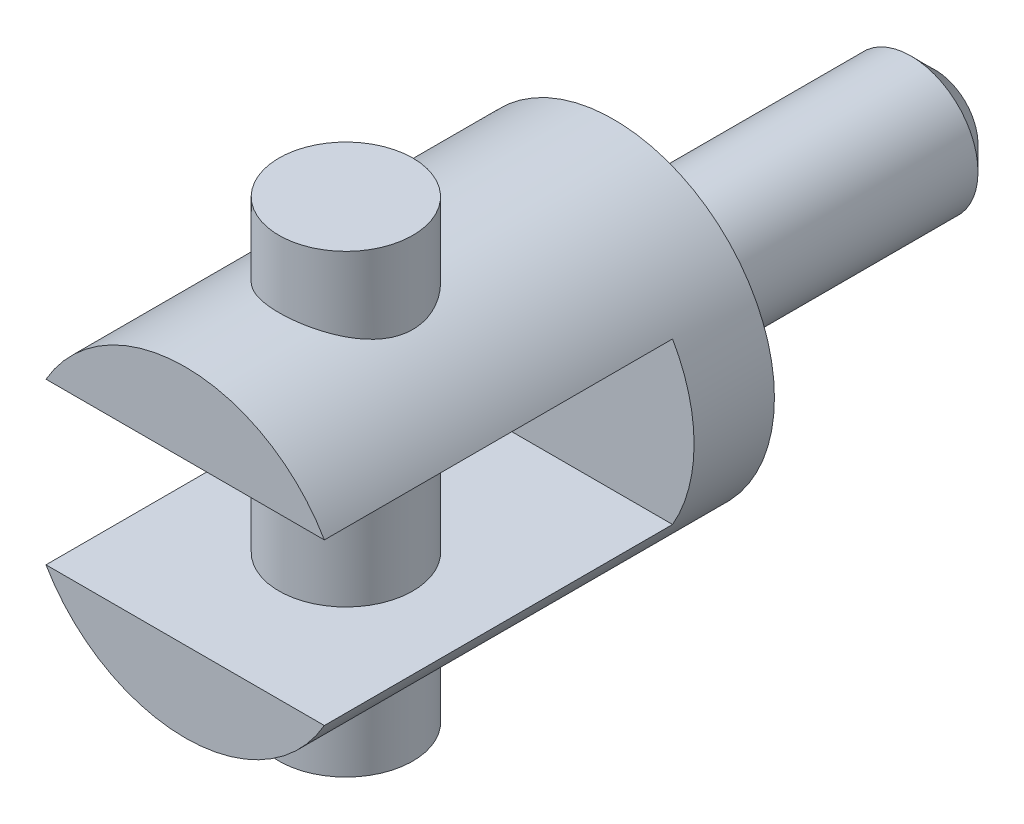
ISO-10303-21;
HEADER;
FILE_DESCRIPTION(('STEP AP214'),'2;1');
FILE_NAME('part.step','',(''),(''),'','','');
FILE_SCHEMA(('AUTOMOTIVE_DESIGN { 1 0 10303 214 1 1 1 1 }'));
ENDSEC;
DATA;
#1=APPLICATION_CONTEXT('core data for automotive mechanical design processes');
#2=APPLICATION_PROTOCOL_DEFINITION('international standard','automotive_design',2000,#1);
#3=PRODUCT_CONTEXT('',#1,'mechanical');
#4=PRODUCT('Part','Part','',(#3));
#5=PRODUCT_RELATED_PRODUCT_CATEGORY('part','',(#4));
#6=PRODUCT_DEFINITION_FORMATION('','',#4);
#7=PRODUCT_DEFINITION_CONTEXT('part definition',#1,'design');
#8=PRODUCT_DEFINITION('design','',#6,#7);
#9=PRODUCT_DEFINITION_SHAPE('','',#8);
#10=(LENGTH_UNIT() NAMED_UNIT(*) SI_UNIT(.MILLI.,.METRE.));
#11=(NAMED_UNIT(*) PLANE_ANGLE_UNIT() SI_UNIT($,.RADIAN.));
#12=(NAMED_UNIT(*) SI_UNIT($,.STERADIAN.) SOLID_ANGLE_UNIT());
#13=UNCERTAINTY_MEASURE_WITH_UNIT(LENGTH_MEASURE(1.E-05),#10,'distance_accuracy_value','');
#14=(GEOMETRIC_REPRESENTATION_CONTEXT(3) GLOBAL_UNCERTAINTY_ASSIGNED_CONTEXT((#13)) GLOBAL_UNIT_ASSIGNED_CONTEXT((#10,
#11,#12)) REPRESENTATION_CONTEXT('',''));
#15=CARTESIAN_POINT('',(0.,0.,0.));
#16=DIRECTION('',(0.,0.,1.));
#17=DIRECTION('',(1.,0.,0.));
#18=AXIS2_PLACEMENT_3D('',#15,#16,#17);
#19=CARTESIAN_POINT('',(0.,0.,16.));
#20=DIRECTION('',(0.,0.,1.));
#21=DIRECTION('',(1.,0.,0.));
#22=AXIS2_PLACEMENT_3D('',#19,#20,#21);
#23=PLANE('',#22);
#24=DIRECTION('',(1.,0.,0.));
#25=VECTOR('',#24,1.);
#26=CARTESIAN_POINT('',(0.,-3.,16.));
#27=LINE('',#26,#25);
#28=CARTESIAN_POINT('',(-5.19615242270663,-3.,16.));
#29=VERTEX_POINT('',#28);
#30=CARTESIAN_POINT('',(5.19615242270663,-3.,16.));
#31=VERTEX_POINT('',#30);
#32=EDGE_CURVE('E37',#29,#31,#27,.T.);
#33=ORIENTED_EDGE('',*,*,#32,.F.);
#34=CARTESIAN_POINT('',(0.,0.,16.));
#35=DIRECTION('',(0.,0.,1.));
#36=DIRECTION('',(1.,0.,0.));
#37=AXIS2_PLACEMENT_3D('',#34,#35,#36);
#38=CIRCLE('',#37,6.);
#39=EDGE_CURVE('E86',#29,#31,#38,.T.);
#40=ORIENTED_EDGE('',*,*,#39,.T.);
#41=EDGE_LOOP('',(#33,#40));
#42=FACE_BOUND('',#41,.T.);
#43=ADVANCED_FACE('F14',(#42),#23,.T.);
#44=DIRECTION('',(-1.,0.,0.));
#45=VECTOR('',#44,1.);
#46=CARTESIAN_POINT('',(0.,3.,16.));
#47=LINE('',#46,#45);
#48=CARTESIAN_POINT('',(5.19615242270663,3.,16.));
#49=VERTEX_POINT('',#48);
#50=CARTESIAN_POINT('',(-5.19615242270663,3.,16.));
#51=VERTEX_POINT('',#50);
#52=EDGE_CURVE('E56',#49,#51,#47,.T.);
#53=ORIENTED_EDGE('',*,*,#52,.F.);
#54=EDGE_CURVE('E85',#49,#51,#38,.T.);
#55=ORIENTED_EDGE('',*,*,#54,.T.);
#56=EDGE_LOOP('',(#53,#55));
#57=FACE_BOUND('',#56,.T.);
#58=ADVANCED_FACE('F150',(#57),#23,.T.);
#59=CARTESIAN_POINT('',(0.,0.,30.));
#60=DIRECTION('',(0.,0.,1.));
#61=DIRECTION('',(1.,0.,0.));
#62=AXIS2_PLACEMENT_3D('',#59,#60,#61);
#63=CYLINDRICAL_SURFACE('',#62,6.);
#64=CARTESIAN_POINT('',(0.,6.,7.5));
#65=CARTESIAN_POINT('',(-0.13390391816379,5.99999628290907,7.5000047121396));
#66=CARTESIAN_POINT('',(-0.268039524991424,5.99546656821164,7.51082131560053));
#67=CARTESIAN_POINT('',(-0.532498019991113,5.97780115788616,7.55368073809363));
#68=CARTESIAN_POINT('',(-0.66281002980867,5.96464300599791,7.58577894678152));
#69=CARTESIAN_POINT('',(-0.915376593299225,5.93112629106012,7.6698214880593));
#70=CARTESIAN_POINT('',(-1.03765681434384,5.91079213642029,7.72169859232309));
#71=CARTESIAN_POINT('',(-1.27165974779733,5.8649055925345,7.84354583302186));
#72=CARTESIAN_POINT('',(-1.38338564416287,5.83935478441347,7.91351048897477));
#73=CARTESIAN_POINT('',(-1.59889674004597,5.78415660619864,8.07325791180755));
#74=CARTESIAN_POINT('',(-1.70208251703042,5.75437507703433,8.1638026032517));
#75=CARTESIAN_POINT('',(-1.8923196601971,5.69465427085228,8.36052868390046));
#76=CARTESIAN_POINT('',(-1.9793625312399,5.66471491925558,8.46671825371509));
#77=CARTESIAN_POINT('',(-2.13907474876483,5.60642043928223,8.69805355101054));
#78=CARTESIAN_POINT('',(-2.2108261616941,5.57821573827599,8.82387489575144));
#79=CARTESIAN_POINT('',(-2.331878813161,5.52871144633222,9.08714651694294));
#80=CARTESIAN_POINT('',(-2.38119161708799,5.50740829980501,9.2245907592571));
#81=CARTESIAN_POINT('',(-2.45349196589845,5.47557110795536,9.50030738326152));
#82=CARTESIAN_POINT('',(-2.47763315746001,5.46456775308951,9.63822096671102));
#83=CARTESIAN_POINT('',(-2.50250419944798,5.45322652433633,9.91654658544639));
#84=CARTESIAN_POINT('',(-2.5032469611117,5.45288276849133,10.0569572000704));
#85=CARTESIAN_POINT('',(-2.48216900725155,5.46250239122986,10.3248001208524));
#86=CARTESIAN_POINT('',(-2.46207362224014,5.47167765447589,10.4524021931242));
#87=CARTESIAN_POINT('',(-2.40278382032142,5.49796965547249,10.7022241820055));
#88=CARTESIAN_POINT('',(-2.36358574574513,5.51508791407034,10.8244430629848));
#89=CARTESIAN_POINT('',(-2.2664391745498,5.55572369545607,11.0631154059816));
#90=CARTESIAN_POINT('',(-2.20810943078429,5.57936963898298,11.1793908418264));
#91=CARTESIAN_POINT('',(-2.07462485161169,5.63036662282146,11.4009554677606));
#92=CARTESIAN_POINT('',(-1.99946338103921,5.65771912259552,11.5062403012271));
#93=CARTESIAN_POINT('',(-1.82699193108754,5.71585953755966,11.7121999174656));
#94=CARTESIAN_POINT('',(-1.72834696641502,5.74674242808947,11.8117331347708));
#95=CARTESIAN_POINT('',(-1.51545918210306,5.80651346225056,11.9932270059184));
#96=CARTESIAN_POINT('',(-1.40121271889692,5.83540113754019,12.0751835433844));
#97=CARTESIAN_POINT('',(-1.15689589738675,5.88876567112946,12.2208716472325));
#98=CARTESIAN_POINT('',(-1.02652116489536,5.91312533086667,12.2841388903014));
#99=CARTESIAN_POINT('',(-0.755704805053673,5.95378962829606,12.3874422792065));
#100=CARTESIAN_POINT('',(-0.615268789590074,5.970098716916,12.4274912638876));
#101=CARTESIAN_POINT('',(-0.337856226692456,5.9919928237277,12.4808319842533));
#102=CARTESIAN_POINT('',(-0.201222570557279,5.9981908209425,12.4956557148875));
#103=CARTESIAN_POINT('',(0.0727093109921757,6.00112100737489,12.5026924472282));
#104=CARTESIAN_POINT('',(0.210007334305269,5.99785591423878,12.494911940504));
#105=CARTESIAN_POINT('',(0.474196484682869,5.9826243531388,12.4580578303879));
#106=CARTESIAN_POINT('',(0.601265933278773,5.97109774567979,12.4300600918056));
#107=CARTESIAN_POINT('',(0.848765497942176,5.94097213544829,12.3550636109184));
#108=CARTESIAN_POINT('',(0.969194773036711,5.92237223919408,12.3080624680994));
#109=CARTESIAN_POINT('',(1.20421799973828,5.87916541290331,12.1948580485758));
#110=CARTESIAN_POINT('',(1.31851447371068,5.85438982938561,12.128103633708));
#111=CARTESIAN_POINT('',(1.53469243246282,5.80147609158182,11.9778932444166));
#112=CARTESIAN_POINT('',(1.63656870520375,5.77333653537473,11.8944302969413));
#113=CARTESIAN_POINT('',(1.83266686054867,5.71424175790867,11.7061935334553));
#114=CARTESIAN_POINT('',(1.92582139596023,5.68322903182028,11.6003229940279));
#115=CARTESIAN_POINT('',(2.09333969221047,5.6236867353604,11.3739574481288));
#116=CARTESIAN_POINT('',(2.16769918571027,5.59515772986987,11.253459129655));
#117=CARTESIAN_POINT('',(2.29631920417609,5.54362772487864,10.9987716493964));
#118=CARTESIAN_POINT('',(2.35027836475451,5.52071125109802,10.8644119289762));
#119=CARTESIAN_POINT('',(2.43434827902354,5.48416711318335,10.5872588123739));
#120=CARTESIAN_POINT('',(2.46447869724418,5.47053179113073,10.4444724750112));
#121=CARTESIAN_POINT('',(2.49808160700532,5.4552632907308,10.1663626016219));
#122=CARTESIAN_POINT('',(2.50342760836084,5.45278701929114,10.0313106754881));
#123=CARTESIAN_POINT('',(2.49231151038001,5.45787706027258,9.76231427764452));
#124=CARTESIAN_POINT('',(2.47585275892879,5.46544183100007,9.6283696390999));
#125=CARTESIAN_POINT('',(2.42316809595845,5.48899102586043,9.37181450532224));
#126=CARTESIAN_POINT('',(2.38789807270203,5.50456709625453,9.24896665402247));
#127=CARTESIAN_POINT('',(2.29952656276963,5.54206362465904,9.01090395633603));
#128=CARTESIAN_POINT('',(2.24642006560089,5.56398586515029,8.89569126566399));
#129=CARTESIAN_POINT('',(2.1202057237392,5.61333908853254,8.66860821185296));
#130=CARTESIAN_POINT('',(2.04608723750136,5.64102204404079,8.55735535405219));
#131=CARTESIAN_POINT('',(1.88136812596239,5.69807379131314,8.34827970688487));
#132=CARTESIAN_POINT('',(1.79076178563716,5.72744316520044,8.25046159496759));
#133=CARTESIAN_POINT('',(1.58780416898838,5.78712781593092,8.06370269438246));
#134=CARTESIAN_POINT('',(1.47434977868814,5.81735619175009,7.9759273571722));
#135=CARTESIAN_POINT('',(1.23319985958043,5.87320303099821,7.82060086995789));
#136=CARTESIAN_POINT('',(1.1054978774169,5.89881939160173,7.75305893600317));
#137=CARTESIAN_POINT('',(0.841465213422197,5.94218308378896,7.6415811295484));
#138=CARTESIAN_POINT('',(0.70531205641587,5.96005349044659,7.59727350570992));
#139=CARTESIAN_POINT('',(0.42681678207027,5.9864223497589,7.53258431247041));
#140=CARTESIAN_POINT('',(0.284495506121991,5.99495014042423,7.5121278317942));
#141=CARTESIAN_POINT('',(0.118052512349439,5.99888566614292,7.50267615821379));
#142=CARTESIAN_POINT('',(0.0944569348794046,5.99930292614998,7.50167339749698));
#143=CARTESIAN_POINT('',(0.0472433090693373,5.99986042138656,7.50033490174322));
#144=CARTESIAN_POINT('',(0.023625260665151,6.0000006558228,7.49999916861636));
#145=CARTESIAN_POINT('',(0.,6.,7.5));
#146=B_SPLINE_CURVE_WITH_KNOTS('',3,(#64,#65,#66,#67,#68,#69,#70,#71,#72,#73,#74,#75,#76,#77,
#78,#79,#80,#81,#82,#83,#84,#85,#86,#87,#88,#89,#90,#91,#92,#93,#94,#95,#96,#97,#98,#99,#100,
#101,#102,#103,#104,#105,#106,#107,#108,#109,#110,#111,#112,#113,#114,#115,#116,#117,#118,#119,
#120,#121,#122,#123,#124,#125,#126,#127,#128,#129,#130,#131,#132,#133,#134,#135,#136,#137,#138,
#139,#140,#141,#142,#143,#144,#145),.UNSPECIFIED.,.T.,.F.,(4,2,2,2,2,2,2,2,2,2,2,2,2,2,2,2,2,2,
2,2,2,2,2,2,2,2,2,2,2,2,2,2,2,2,2,2,2,2,2,2,4),(0.,0.401613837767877,0.804277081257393,
1.2055837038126,1.60676887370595,2.02635872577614,2.44616876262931,2.88663449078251,
3.32687293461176,3.74590546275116,4.16470676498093,4.55140314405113,4.93817359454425,
5.33317426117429,5.72833091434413,6.15688282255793,6.58553498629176,7.02408110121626,
7.46238448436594,7.87296886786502,8.28343534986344,8.67353179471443,9.0636775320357,
9.46594270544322,9.86837610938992,10.2995697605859,10.7308612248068,11.1682957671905,
11.6053689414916,12.0087975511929,12.4121642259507,12.7967529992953,13.1814498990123,
13.5892778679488,13.9972474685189,14.4349307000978,14.8728129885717,15.3034571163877,
15.7327450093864,15.8036033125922,15.8744618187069),.UNSPECIFIED.);
#147=CARTESIAN_POINT('',(0.,6.,7.5));
#148=VERTEX_POINT('',#147);
#149=EDGE_CURVE('E98',#148,#148,#146,.T.);
#150=ORIENTED_EDGE('',*,*,#149,.F.);
#151=EDGE_LOOP('',(#150));
#152=FACE_BOUND('',#151,.T.);
#153=CARTESIAN_POINT('',(0.,-6.,7.5));
#154=CARTESIAN_POINT('',(0.13390391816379,-5.99999628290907,7.5000047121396));
#155=CARTESIAN_POINT('',(0.268039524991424,-5.99546656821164,7.51082131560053));
#156=CARTESIAN_POINT('',(0.532498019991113,-5.97780115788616,7.55368073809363));
#157=CARTESIAN_POINT('',(0.66281002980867,-5.96464300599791,7.58577894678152));
#158=CARTESIAN_POINT('',(0.915376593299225,-5.93112629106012,7.6698214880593));
#159=CARTESIAN_POINT('',(1.03765681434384,-5.91079213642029,7.72169859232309));
#160=CARTESIAN_POINT('',(1.27165974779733,-5.8649055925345,7.84354583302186));
#161=CARTESIAN_POINT('',(1.38338564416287,-5.83935478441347,7.91351048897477));
#162=CARTESIAN_POINT('',(1.59889674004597,-5.78415660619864,8.07325791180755));
#163=CARTESIAN_POINT('',(1.70208251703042,-5.75437507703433,8.1638026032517));
#164=CARTESIAN_POINT('',(1.8923196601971,-5.69465427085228,8.36052868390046));
#165=CARTESIAN_POINT('',(1.9793625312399,-5.66471491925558,8.46671825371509));
#166=CARTESIAN_POINT('',(2.13907474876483,-5.60642043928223,8.69805355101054));
#167=CARTESIAN_POINT('',(2.2108261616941,-5.57821573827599,8.82387489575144));
#168=CARTESIAN_POINT('',(2.331878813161,-5.52871144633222,9.08714651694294));
#169=CARTESIAN_POINT('',(2.38119161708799,-5.50740829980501,9.2245907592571));
#170=CARTESIAN_POINT('',(2.45349196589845,-5.47557110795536,9.50030738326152));
#171=CARTESIAN_POINT('',(2.47763315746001,-5.46456775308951,9.63822096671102));
#172=CARTESIAN_POINT('',(2.50250419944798,-5.45322652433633,9.91654658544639));
#173=CARTESIAN_POINT('',(2.5032469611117,-5.45288276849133,10.0569572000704));
#174=CARTESIAN_POINT('',(2.48216900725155,-5.46250239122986,10.3248001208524));
#175=CARTESIAN_POINT('',(2.46207362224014,-5.47167765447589,10.4524021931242));
#176=CARTESIAN_POINT('',(2.40278382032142,-5.49796965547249,10.7022241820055));
#177=CARTESIAN_POINT('',(2.36358574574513,-5.51508791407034,10.8244430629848));
#178=CARTESIAN_POINT('',(2.2664391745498,-5.55572369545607,11.0631154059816));
#179=CARTESIAN_POINT('',(2.20810943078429,-5.57936963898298,11.1793908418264));
#180=CARTESIAN_POINT('',(2.07462485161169,-5.63036662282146,11.4009554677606));
#181=CARTESIAN_POINT('',(1.99946338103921,-5.65771912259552,11.5062403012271));
#182=CARTESIAN_POINT('',(1.82699193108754,-5.71585953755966,11.7121999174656));
#183=CARTESIAN_POINT('',(1.72834696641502,-5.74674242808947,11.8117331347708));
#184=CARTESIAN_POINT('',(1.51545918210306,-5.80651346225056,11.9932270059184));
#185=CARTESIAN_POINT('',(1.40121271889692,-5.83540113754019,12.0751835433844));
#186=CARTESIAN_POINT('',(1.15689589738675,-5.88876567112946,12.2208716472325));
#187=CARTESIAN_POINT('',(1.02652116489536,-5.91312533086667,12.2841388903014));
#188=CARTESIAN_POINT('',(0.755704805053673,-5.95378962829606,12.3874422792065));
#189=CARTESIAN_POINT('',(0.615268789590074,-5.970098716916,12.4274912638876));
#190=CARTESIAN_POINT('',(0.337856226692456,-5.9919928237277,12.4808319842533));
#191=CARTESIAN_POINT('',(0.201222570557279,-5.9981908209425,12.4956557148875));
#192=CARTESIAN_POINT('',(-0.0727093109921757,-6.00112100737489,12.5026924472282));
#193=CARTESIAN_POINT('',(-0.210007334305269,-5.99785591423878,12.494911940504));
#194=CARTESIAN_POINT('',(-0.474196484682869,-5.9826243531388,12.4580578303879));
#195=CARTESIAN_POINT('',(-0.601265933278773,-5.97109774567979,12.4300600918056));
#196=CARTESIAN_POINT('',(-0.848765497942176,-5.94097213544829,12.3550636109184));
#197=CARTESIAN_POINT('',(-0.969194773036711,-5.92237223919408,12.3080624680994));
#198=CARTESIAN_POINT('',(-1.20421799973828,-5.87916541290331,12.1948580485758));
#199=CARTESIAN_POINT('',(-1.31851447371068,-5.85438982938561,12.128103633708));
#200=CARTESIAN_POINT('',(-1.53469243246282,-5.80147609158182,11.9778932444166));
#201=CARTESIAN_POINT('',(-1.63656870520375,-5.77333653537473,11.8944302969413));
#202=CARTESIAN_POINT('',(-1.83266686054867,-5.71424175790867,11.7061935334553));
#203=CARTESIAN_POINT('',(-1.92582139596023,-5.68322903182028,11.6003229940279));
#204=CARTESIAN_POINT('',(-2.09333969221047,-5.6236867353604,11.3739574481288));
#205=CARTESIAN_POINT('',(-2.16769918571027,-5.59515772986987,11.253459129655));
#206=CARTESIAN_POINT('',(-2.29631920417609,-5.54362772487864,10.9987716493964));
#207=CARTESIAN_POINT('',(-2.35027836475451,-5.52071125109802,10.8644119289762));
#208=CARTESIAN_POINT('',(-2.43434827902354,-5.48416711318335,10.5872588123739));
#209=CARTESIAN_POINT('',(-2.46447869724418,-5.47053179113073,10.4444724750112));
#210=CARTESIAN_POINT('',(-2.49808160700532,-5.4552632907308,10.1663626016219));
#211=CARTESIAN_POINT('',(-2.50342760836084,-5.45278701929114,10.0313106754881));
#212=CARTESIAN_POINT('',(-2.49231151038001,-5.45787706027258,9.76231427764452));
#213=CARTESIAN_POINT('',(-2.47585275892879,-5.46544183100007,9.6283696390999));
#214=CARTESIAN_POINT('',(-2.42316809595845,-5.48899102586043,9.37181450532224));
#215=CARTESIAN_POINT('',(-2.38789807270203,-5.50456709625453,9.24896665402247));
#216=CARTESIAN_POINT('',(-2.29952656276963,-5.54206362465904,9.01090395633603));
#217=CARTESIAN_POINT('',(-2.24642006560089,-5.56398586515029,8.89569126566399));
#218=CARTESIAN_POINT('',(-2.1202057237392,-5.61333908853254,8.66860821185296));
#219=CARTESIAN_POINT('',(-2.04608723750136,-5.64102204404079,8.55735535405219));
#220=CARTESIAN_POINT('',(-1.88136812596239,-5.69807379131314,8.34827970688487));
#221=CARTESIAN_POINT('',(-1.79076178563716,-5.72744316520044,8.25046159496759));
#222=CARTESIAN_POINT('',(-1.58780416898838,-5.78712781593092,8.06370269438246));
#223=CARTESIAN_POINT('',(-1.47434977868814,-5.81735619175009,7.9759273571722));
#224=CARTESIAN_POINT('',(-1.23319985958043,-5.87320303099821,7.82060086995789));
#225=CARTESIAN_POINT('',(-1.1054978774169,-5.89881939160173,7.75305893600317));
#226=CARTESIAN_POINT('',(-0.841465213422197,-5.94218308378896,7.6415811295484));
#227=CARTESIAN_POINT('',(-0.70531205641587,-5.96005349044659,7.59727350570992));
#228=CARTESIAN_POINT('',(-0.42681678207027,-5.9864223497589,7.53258431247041));
#229=CARTESIAN_POINT('',(-0.284495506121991,-5.99495014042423,7.5121278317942));
#230=CARTESIAN_POINT('',(-0.118052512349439,-5.99888566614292,7.50267615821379));
#231=CARTESIAN_POINT('',(-0.0944569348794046,-5.99930292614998,7.50167339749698));
#232=CARTESIAN_POINT('',(-0.0472433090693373,-5.99986042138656,7.50033490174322));
#233=CARTESIAN_POINT('',(-0.023625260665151,-6.0000006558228,7.49999916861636));
#234=CARTESIAN_POINT('',(0.,-6.,7.5));
#235=B_SPLINE_CURVE_WITH_KNOTS('',3,(#153,#154,#155,#156,#157,#158,#159,#160,#161,#162,#163,
#164,#165,#166,#167,#168,#169,#170,#171,#172,#173,#174,#175,#176,#177,#178,#179,#180,#181,#182,
#183,#184,#185,#186,#187,#188,#189,#190,#191,#192,#193,#194,#195,#196,#197,#198,#199,#200,#201,
#202,#203,#204,#205,#206,#207,#208,#209,#210,#211,#212,#213,#214,#215,#216,#217,#218,#219,#220,
#221,#222,#223,#224,#225,#226,#227,#228,#229,#230,#231,#232,#233,#234),.UNSPECIFIED.,.T.,.F.,(4,
2,2,2,2,2,2,2,2,2,2,2,2,2,2,2,2,2,2,2,2,2,2,2,2,2,2,2,2,2,2,2,2,2,2,2,2,2,2,2,4),(0.,
0.401613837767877,0.804277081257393,1.2055837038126,1.60676887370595,2.02635872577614,
2.44616876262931,2.88663449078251,3.32687293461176,3.74590546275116,4.16470676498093,
4.55140314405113,4.93817359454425,5.33317426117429,5.72833091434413,6.15688282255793,
6.58553498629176,7.02408110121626,7.46238448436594,7.87296886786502,8.28343534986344,
8.67353179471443,9.0636775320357,9.46594270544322,9.86837610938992,10.2995697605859,
10.7308612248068,11.1682957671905,11.6053689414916,12.0087975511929,12.4121642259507,
12.7967529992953,13.1814498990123,13.5892778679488,13.9972474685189,14.4349307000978,
14.8728129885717,15.3034571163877,15.7327450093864,15.8036033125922,15.8744618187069),.UNSPECIFIED.);
#236=CARTESIAN_POINT('',(0.,-6.,7.5));
#237=VERTEX_POINT('',#236);
#238=EDGE_CURVE('E80',#237,#237,#235,.T.);
#239=ORIENTED_EDGE('',*,*,#238,.F.);
#240=EDGE_LOOP('',(#239));
#241=FACE_BOUND('',#240,.T.);
#242=DIRECTION('',(0.,0.,1.));
#243=VECTOR('',#242,1.);
#244=CARTESIAN_POINT('',(-5.19615242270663,-3.,30.));
#245=LINE('',#244,#243);
#246=CARTESIAN_POINT('',(-5.19615242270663,-3.,3.));
#247=VERTEX_POINT('',#246);
#248=EDGE_CURVE('E78',#247,#29,#245,.T.);
#249=ORIENTED_EDGE('',*,*,#248,.F.);
#250=CARTESIAN_POINT('',(0.,0.,3.));
#251=DIRECTION('',(0.,0.,-1.));
#252=DIRECTION('',(-1.,0.,0.));
#253=AXIS2_PLACEMENT_3D('',#250,#251,#252);
#254=CIRCLE('',#253,6.);
#255=CARTESIAN_POINT('',(-5.19615242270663,3.,3.));
#256=VERTEX_POINT('',#255);
#257=EDGE_CURVE('E61',#256,#247,#254,.F.);
#258=ORIENTED_EDGE('',*,*,#257,.F.);
#259=DIRECTION('',(0.,0.,1.));
#260=VECTOR('',#259,1.);
#261=CARTESIAN_POINT('',(-5.19615242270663,3.,30.));
#262=LINE('',#261,#260);
#263=EDGE_CURVE('E53',#51,#256,#262,.F.);
#264=ORIENTED_EDGE('',*,*,#263,.F.);
#265=ORIENTED_EDGE('',*,*,#54,.F.);
#266=DIRECTION('',(0.,0.,1.));
#267=VECTOR('',#266,1.);
#268=CARTESIAN_POINT('',(5.19615242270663,3.,30.));
#269=LINE('',#268,#267);
#270=CARTESIAN_POINT('',(5.19615242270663,3.,3.));
#271=VERTEX_POINT('',#270);
#272=EDGE_CURVE('E84',#271,#49,#269,.T.);
#273=ORIENTED_EDGE('',*,*,#272,.F.);
#274=CARTESIAN_POINT('',(5.19615242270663,-3.,3.));
#275=VERTEX_POINT('',#274);
#276=EDGE_CURVE('E69',#275,#271,#254,.F.);
#277=ORIENTED_EDGE('',*,*,#276,.F.);
#278=DIRECTION('',(0.,0.,1.));
#279=VECTOR('',#278,1.);
#280=CARTESIAN_POINT('',(5.19615242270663,-3.,30.));
#281=LINE('',#280,#279);
#282=EDGE_CURVE('E62',#31,#275,#281,.F.);
#283=ORIENTED_EDGE('',*,*,#282,.F.);
#284=ORIENTED_EDGE('',*,*,#39,.F.);
#285=EDGE_LOOP('',(#249,#258,#264,#265,#273,#277,#283,#284));
#286=FACE_BOUND('',#285,.T.);
#287=CARTESIAN_POINT('',(0.,0.,0.));
#288=DIRECTION('',(0.,0.,1.));
#289=DIRECTION('',(1.,0.,0.));
#290=AXIS2_PLACEMENT_3D('',#287,#288,#289);
#291=CIRCLE('',#290,6.);
#292=CARTESIAN_POINT('',(6.,0.,0.));
#293=VERTEX_POINT('',#292);
#294=EDGE_CURVE('E89',#293,#293,#291,.T.);
#295=ORIENTED_EDGE('',*,*,#294,.T.);
#296=EDGE_LOOP('',(#295));
#297=FACE_BOUND('',#296,.T.);
#298=ADVANCED_FACE('F75',(#152,#241,#286,#297),#63,.T.);
#299=CARTESIAN_POINT('',(6.,0.,0.));
#300=DIRECTION('',(0.,0.,-1.));
#301=DIRECTION('',(-1.,0.,0.));
#302=AXIS2_PLACEMENT_3D('',#299,#300,#301);
#303=PLANE('',#302);
#304=CARTESIAN_POINT('',(0.,0.,0.));
#305=DIRECTION('',(0.,0.,1.));
#306=DIRECTION('',(1.,0.,0.));
#307=AXIS2_PLACEMENT_3D('',#304,#305,#306);
#308=CIRCLE('',#307,2.5);
#309=CARTESIAN_POINT('',(2.5,0.,0.));
#310=VERTEX_POINT('',#309);
#311=EDGE_CURVE('E92',#310,#310,#308,.T.);
#312=ORIENTED_EDGE('',*,*,#311,.T.);
#313=EDGE_LOOP('',(#312));
#314=FACE_BOUND('',#313,.T.);
#315=ORIENTED_EDGE('',*,*,#294,.F.);
#316=EDGE_LOOP('',(#315));
#317=FACE_BOUND('',#316,.T.);
#318=ADVANCED_FACE('F141',(#314,#317),#303,.T.);
#319=CARTESIAN_POINT('',(0.,0.,30.));
#320=DIRECTION('',(0.,0.,1.));
#321=DIRECTION('',(1.,0.,0.));
#322=AXIS2_PLACEMENT_3D('',#319,#320,#321);
#323=CYLINDRICAL_SURFACE('',#322,2.5);
#324=CARTESIAN_POINT('',(0.,0.,-11.1));
#325=DIRECTION('',(0.,0.,-1.));
#326=DIRECTION('',(-1.,0.,0.));
#327=AXIS2_PLACEMENT_3D('',#324,#325,#326);
#328=CIRCLE('',#327,2.5);
#329=CARTESIAN_POINT('',(-2.5,0.,-11.1));
#330=VERTEX_POINT('',#329);
#331=EDGE_CURVE('E22',#330,#330,#328,.F.);
#332=ORIENTED_EDGE('',*,*,#331,.T.);
#333=EDGE_LOOP('',(#332));
#334=FACE_BOUND('',#333,.T.);
#335=ORIENTED_EDGE('',*,*,#311,.F.);
#336=EDGE_LOOP('',(#335));
#337=FACE_BOUND('',#336,.T.);
#338=ADVANCED_FACE('F138',(#334,#337),#323,.T.);
#339=CARTESIAN_POINT('',(2.5,0.,-12.));
#340=DIRECTION('',(0.,0.,-1.));
#341=DIRECTION('',(-1.,0.,0.));
#342=AXIS2_PLACEMENT_3D('',#339,#340,#341);
#343=PLANE('',#342);
#344=CARTESIAN_POINT('',(0.,0.,-12.));
#345=DIRECTION('',(0.,0.,-1.));
#346=DIRECTION('',(-1.,0.,0.));
#347=AXIS2_PLACEMENT_3D('',#344,#345,#346);
#348=CIRCLE('',#347,1.6);
#349=CARTESIAN_POINT('',(-1.6,0.,-12.));
#350=VERTEX_POINT('',#349);
#351=EDGE_CURVE('E9',#350,#350,#348,.T.);
#352=ORIENTED_EDGE('',*,*,#351,.T.);
#353=EDGE_LOOP('',(#352));
#354=FACE_BOUND('',#353,.T.);
#355=ADVANCED_FACE('F129',(#354),#343,.T.);
#356=CARTESIAN_POINT('',(-10.,-3.,3.));
#357=DIRECTION('',(0.,0.,-1.));
#358=DIRECTION('',(-1.,0.,0.));
#359=AXIS2_PLACEMENT_3D('',#356,#357,#358);
#360=PLANE('',#359);
#361=ORIENTED_EDGE('',*,*,#276,.T.);
#362=DIRECTION('',(1.,0.,0.));
#363=VECTOR('',#362,1.);
#364=CARTESIAN_POINT('',(-10.,3.,3.));
#365=LINE('',#364,#363);
#366=EDGE_CURVE('E29',#256,#271,#365,.T.);
#367=ORIENTED_EDGE('',*,*,#366,.F.);
#368=ORIENTED_EDGE('',*,*,#257,.T.);
#369=DIRECTION('',(1.,0.,0.));
#370=VECTOR('',#369,1.);
#371=CARTESIAN_POINT('',(-10.,-3.,3.));
#372=LINE('',#371,#370);
#373=EDGE_CURVE('E71',#247,#275,#372,.T.);
#374=ORIENTED_EDGE('',*,*,#373,.T.);
#375=EDGE_LOOP('',(#361,#367,#368,#374));
#376=FACE_BOUND('',#375,.T.);
#377=ADVANCED_FACE('F65',(#376),#360,.F.);
#378=CARTESIAN_POINT('',(-10.,-3.,20.));
#379=DIRECTION('',(0.,-1.,0.));
#380=DIRECTION('',(0.,0.,-1.));
#381=AXIS2_PLACEMENT_3D('',#378,#379,#380);
#382=PLANE('',#381);
#383=CARTESIAN_POINT('',(0.,-3.,10.));
#384=DIRECTION('',(0.,-1.,0.));
#385=DIRECTION('',(0.,0.,-1.));
#386=AXIS2_PLACEMENT_3D('',#383,#384,#385);
#387=CIRCLE('',#386,2.5);
#388=CARTESIAN_POINT('',(0.,-3.,7.5));
#389=VERTEX_POINT('',#388);
#390=EDGE_CURVE('E72',#389,#389,#387,.T.);
#391=ORIENTED_EDGE('',*,*,#390,.T.);
#392=EDGE_LOOP('',(#391));
#393=FACE_BOUND('',#392,.T.);
#394=ORIENTED_EDGE('',*,*,#282,.T.);
#395=ORIENTED_EDGE('',*,*,#373,.F.);
#396=ORIENTED_EDGE('',*,*,#248,.T.);
#397=ORIENTED_EDGE('',*,*,#32,.T.);
#398=EDGE_LOOP('',(#394,#395,#396,#397));
#399=FACE_BOUND('',#398,.T.);
#400=ADVANCED_FACE('F128',(#393,#399),#382,.F.);
#401=CARTESIAN_POINT('',(-10.,3.,3.));
#402=DIRECTION('',(0.,1.,0.));
#403=DIRECTION('',(0.,0.,1.));
#404=AXIS2_PLACEMENT_3D('',#401,#402,#403);
#405=PLANE('',#404);
#406=CARTESIAN_POINT('',(0.,3.,10.));
#407=DIRECTION('',(0.,1.,0.));
#408=DIRECTION('',(0.,0.,1.));
#409=AXIS2_PLACEMENT_3D('',#406,#407,#408);
#410=CIRCLE('',#409,2.5);
#411=CARTESIAN_POINT('',(0.,3.,12.5));
#412=VERTEX_POINT('',#411);
#413=EDGE_CURVE('E262',#412,#412,#410,.T.);
#414=ORIENTED_EDGE('',*,*,#413,.T.);
#415=EDGE_LOOP('',(#414));
#416=FACE_BOUND('',#415,.T.);
#417=ORIENTED_EDGE('',*,*,#263,.T.);
#418=ORIENTED_EDGE('',*,*,#366,.T.);
#419=ORIENTED_EDGE('',*,*,#272,.T.);
#420=ORIENTED_EDGE('',*,*,#52,.T.);
#421=EDGE_LOOP('',(#417,#418,#419,#420));
#422=FACE_BOUND('',#421,.T.);
#423=ADVANCED_FACE('F54',(#416,#422),#405,.F.);
#424=CARTESIAN_POINT('',(0.,-20.,10.));
#425=DIRECTION('',(0.,-1.,0.));
#426=DIRECTION('',(0.,0.,-1.));
#427=AXIS2_PLACEMENT_3D('',#424,#425,#426);
#428=CYLINDRICAL_SURFACE('',#427,2.5);
#429=ORIENTED_EDGE('',*,*,#413,.F.);
#430=EDGE_LOOP('',(#429));
#431=FACE_BOUND('',#430,.T.);
#432=ORIENTED_EDGE('',*,*,#390,.F.);
#433=EDGE_LOOP('',(#432));
#434=FACE_BOUND('',#433,.T.);
#435=ADVANCED_FACE('F120',(#431,#434),#428,.T.);
#436=CARTESIAN_POINT('',(0.,-8.5,10.));
#437=DIRECTION('',(0.,-1.,0.));
#438=DIRECTION('',(0.,0.,-1.));
#439=AXIS2_PLACEMENT_3D('',#436,#437,#438);
#440=PLANE('',#439);
#441=CARTESIAN_POINT('',(0.,-8.5,10.));
#442=DIRECTION('',(0.,-1.,0.));
#443=DIRECTION('',(0.,0.,-1.));
#444=AXIS2_PLACEMENT_3D('',#441,#442,#443);
#445=CIRCLE('',#444,2.5);
#446=CARTESIAN_POINT('',(0.,-8.5,7.5));
#447=VERTEX_POINT('',#446);
#448=EDGE_CURVE('E265',#447,#447,#445,.T.);
#449=ORIENTED_EDGE('',*,*,#448,.T.);
#450=EDGE_LOOP('',(#449));
#451=FACE_BOUND('',#450,.T.);
#452=ADVANCED_FACE('F121',(#451),#440,.T.);
#453=ORIENTED_EDGE('',*,*,#238,.T.);
#454=EDGE_LOOP('',(#453));
#455=FACE_BOUND('',#454,.T.);
#456=ORIENTED_EDGE('',*,*,#448,.F.);
#457=EDGE_LOOP('',(#456));
#458=FACE_BOUND('',#457,.T.);
#459=ADVANCED_FACE('F118',(#455,#458),#428,.T.);
#460=ORIENTED_EDGE('',*,*,#149,.T.);
#461=EDGE_LOOP('',(#460));
#462=FACE_BOUND('',#461,.T.);
#463=CARTESIAN_POINT('',(0.,8.5,10.));
#464=DIRECTION('',(0.,-1.,0.));
#465=DIRECTION('',(0.,0.,-1.));
#466=AXIS2_PLACEMENT_3D('',#463,#464,#465);
#467=CIRCLE('',#466,2.5);
#468=CARTESIAN_POINT('',(0.,8.5,7.5));
#469=VERTEX_POINT('',#468);
#470=EDGE_CURVE('E270',#469,#469,#467,.T.);
#471=ORIENTED_EDGE('',*,*,#470,.T.);
#472=EDGE_LOOP('',(#471));
#473=FACE_BOUND('',#472,.T.);
#474=ADVANCED_FACE('F112',(#462,#473),#428,.T.);
#475=CARTESIAN_POINT('',(0.,8.5,12.5));
#476=DIRECTION('',(0.,1.,0.));
#477=DIRECTION('',(0.,0.,1.));
#478=AXIS2_PLACEMENT_3D('',#475,#476,#477);
#479=PLANE('',#478);
#480=ORIENTED_EDGE('',*,*,#470,.F.);
#481=EDGE_LOOP('',(#480));
#482=FACE_BOUND('',#481,.T.);
#483=ADVANCED_FACE('F117',(#482),#479,.T.);
#484=CARTESIAN_POINT('',(0.,0.,-11.1));
#485=DIRECTION('',(0.,0.,1.));
#486=DIRECTION('',(1.,0.,0.));
#487=AXIS2_PLACEMENT_3D('',#484,#485,#486);
#488=CONICAL_SURFACE('',#487,2.5,0.78539816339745);
#489=ORIENTED_EDGE('',*,*,#351,.F.);
#490=EDGE_LOOP('',(#489));
#491=FACE_BOUND('',#490,.T.);
#492=ORIENTED_EDGE('',*,*,#331,.F.);
#493=EDGE_LOOP('',(#492));
#494=FACE_BOUND('',#493,.T.);
#495=ADVANCED_FACE('F16',(#491,#494),#488,.T.);
#496=CLOSED_SHELL('',(#43,#58,#298,#318,#338,#355,#377,#400,#423,#435,#452,#459,#474,#483,#495));
#497=MANIFOLD_SOLID_BREP('B1',#496);
#498=ADVANCED_BREP_SHAPE_REPRESENTATION('',(#18,#497),#14);
#499=SHAPE_DEFINITION_REPRESENTATION(#9,#498);
ENDSEC;
END-ISO-10303-21;
